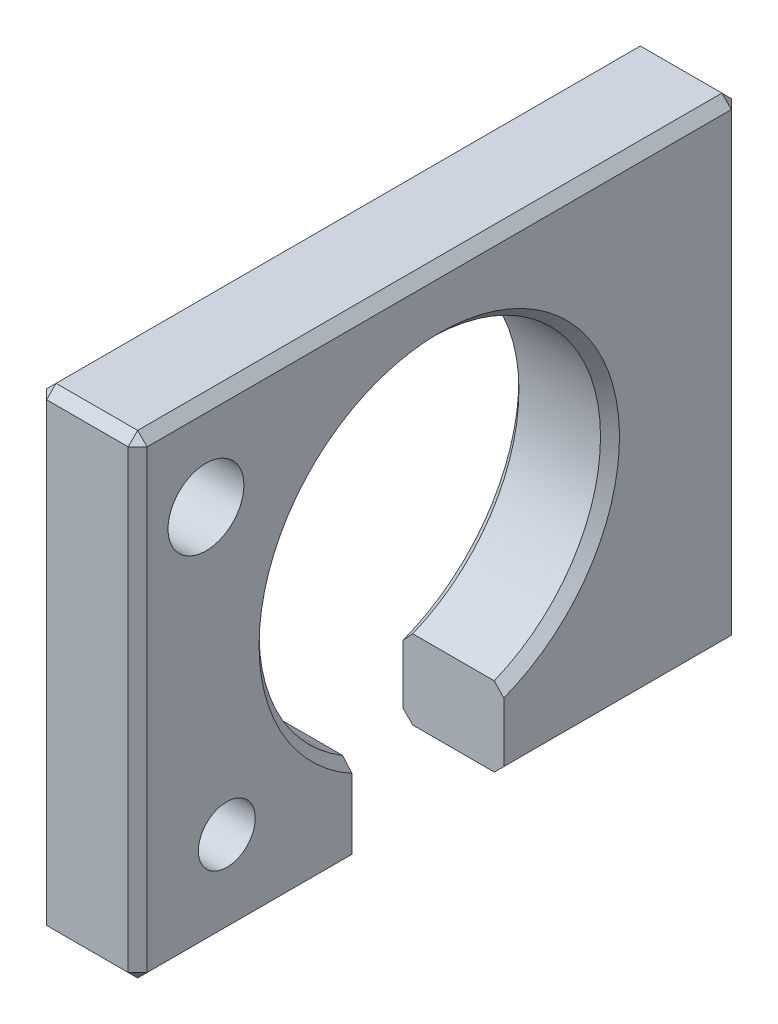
from build123d import *

# Parameters (mm, degrees)
BASE_EXTRUSION_DEPTH    = 2.65
ENL_V_MAT_EXTRU_1_REACH = 22.908
ESQUISSE2_R             = 1.5
ESQUISSE2_R_2           = 2
CHANFREIN1_SIZE         = 0.5


with BuildPart() as part:
    # Esquisse1 → Base-Extrusion (new, symmetric)
    with BuildSketch(Plane(origin=(0, 0, 0), x_dir=(0, 0, -1), z_dir=(1, 0, 0))):
        with BuildLine():
            Line((3.4, -8.333066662), (3.4, -12.5))
            Line((3.4, -12.5), (15.9, -12.5))
            Line((15.9, -12.5), (15.9, 12.5))
            Line((15.9, 12.5), (-15.9, 12.5))
            Line((-15.9, 12.5), (-15.9, -12.5))
            Line((-15.9, -12.5), (-4.6, -12.5))
            Line((-4.6, -12.5), (-4.6, -7.735631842))
            ThreePointArc((-4.6, -7.735631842), (0.670247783, 8.975007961), (3.4, -8.333066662))
        make_face()
    extrude(amount=BASE_EXTRUSION_DEPTH, both=True)

    # Esquisse2 → Enl_v. mat.-Extru.1 (cut, up to next)
    with BuildSketch(Plane(origin=(2.65, 0, 0), x_dir=(0, 0, -1), z_dir=(1, 0, 0)), mode=Mode.PRIVATE) as enl_v_mat_extru_1_sk1:
        with Locations((-11.2, -7.8)):
            Circle(ESQUISSE2_R)
    enl_v_mat_extru_1_tool1 = extrude(enl_v_mat_extru_1_sk1.sketch, amount=-ENL_V_MAT_EXTRU_1_REACH, mode=Mode.PRIVATE) & part.part
    # Esquisse2 → Enl_v. mat.-Extru.1 (cut, up to next)
    with BuildSketch(Plane(origin=(2.65, 0, 0), x_dir=(0, 0, -1), z_dir=(1, 0, 0)), mode=Mode.PRIVATE) as enl_v_mat_extru_1_sk2:
        with Locations((-12.3, 7.7)):
            Circle(ESQUISSE2_R_2)
    enl_v_mat_extru_1_tool2 = extrude(enl_v_mat_extru_1_sk2.sketch, amount=-ENL_V_MAT_EXTRU_1_REACH, mode=Mode.PRIVATE) & part.part
    add(enl_v_mat_extru_1_tool1.solids().sort_by_distance((2.65, -7.8, 11.2))[0], mode=Mode.SUBTRACT)
    add(enl_v_mat_extru_1_tool2.solids().sort_by_distance((2.65, 7.7, 12.3))[0], mode=Mode.SUBTRACT)

    # Chanfrein1
    chanfrein1_edges = [part.edges().sort_by_distance(p)[0] for p in [
        (-2.65, -12.5, 10.25),
        (-2.65, 0, 15.9),
        (2.65, 8.975007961, -0.670247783),
        (0, 12.5, 15.9),
        (0, 12.5, -15.9),
        (0, -12.5, -15.9),
        (0, -12.5, 15.9),
        (2.65, -12.5, -9.65),
        (2.65, 0, -15.9),
        (2.65, 12.5, 0),
        (2.65, 0, 15.9),
        (2.65, -12.5, 10.25),
        (-2.65, 12.5, 0),
        (-2.65, 0, -15.9),
        (-2.65, -12.5, -9.65),
        (-2.65, 8.975007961, -0.670247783),
    ]]
    chamfer(chanfrein1_edges, length=CHANFREIN1_SIZE)


solid = part.part
